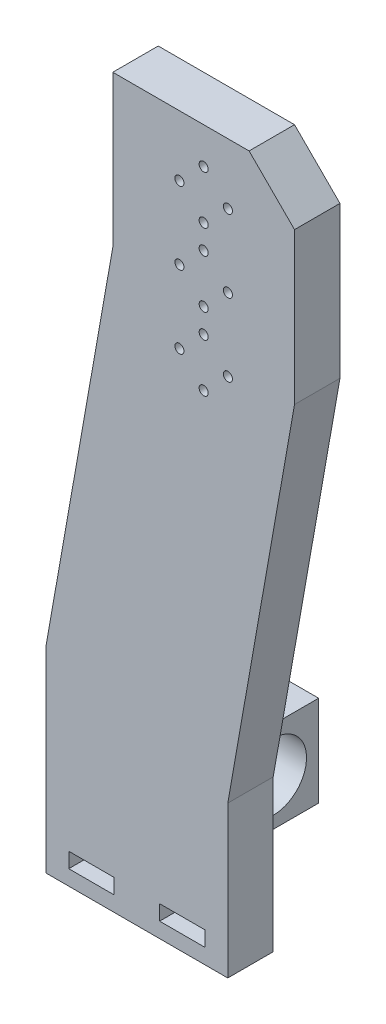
from build123d import *

# Parameters (mm, degrees)
CROQUIS1_R              = 1.5
CROQUIS1_W              = 15
CROQUIS1_H              = 5
SALIENTE_EXTRUIR1_DEPTH = 15
CROQUIS2_W              = 30
CROQUIS2_H              = 30
SALIENTE_EXTRUIR2_DEPTH = 30
CROQUIS3_R              = 11
CORTAR_EXTRUIR1_DEPTH   = 50


with BuildPart() as part:
    # Croquis1 → Saliente-Extruir1 (new body)
    with BuildSketch(Plane.XY):
        Polygon((0, 0), (60, 0), (60, 50), (82.040872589, 175), (82.040872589, 225), (67.040872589, 240), (22.040872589, 240), (22.040872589, 190), (0, 65), align=None)
        with Locations((44.040872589, 220)):
            Circle(CROQUIS1_R, mode=Mode.SUBTRACT)
        with Locations((52.040872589, 228)):
            Circle(CROQUIS1_R, mode=Mode.SUBTRACT)
        with Locations((60.040872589, 220)):
            Circle(CROQUIS1_R, mode=Mode.SUBTRACT)
        with Locations((52.040872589, 212)):
            Circle(CROQUIS1_R, mode=Mode.SUBTRACT)
        with Locations(Location((52.040872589, 204, 0), (0, 0, 180))):
            Circle(CROQUIS1_R, mode=Mode.SUBTRACT)
        with Locations(Location((60.040872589, 196, 0), (0, 0, 180))):
            Circle(CROQUIS1_R, mode=Mode.SUBTRACT)
        with Locations(Location((52.040872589, 188, 0), (0, 0, 180))):
            Circle(CROQUIS1_R, mode=Mode.SUBTRACT)
        with Locations(Location((44.040872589, 196, 0), (0, 0, 180))):
            Circle(CROQUIS1_R, mode=Mode.SUBTRACT)
        with Locations((44.040872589, 172)):
            Circle(CROQUIS1_R, mode=Mode.SUBTRACT)
        with Locations((52.040872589, 180)):
            Circle(CROQUIS1_R, mode=Mode.SUBTRACT)
        with Locations((60.040872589, 172)):
            Circle(CROQUIS1_R, mode=Mode.SUBTRACT)
        with Locations((52.040872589, 164)):
            Circle(CROQUIS1_R, mode=Mode.SUBTRACT)
        with Locations((15, 7.5)):
            Rectangle(CROQUIS1_W, CROQUIS1_H, mode=Mode.SUBTRACT)
        with Locations((45, 7.5)):
            Rectangle(CROQUIS1_W, CROQUIS1_H, mode=Mode.SUBTRACT)
    extrude(amount=SALIENTE_EXTRUIR1_DEPTH)

    # Croquis2 → Saliente-Extruir2 (add)
    with BuildSketch(Plane(origin=(0, 0, 0), x_dir=(-1, 0, 0), z_dir=(0, 0, -1))):
        with Locations((-30, 35)):
            Rectangle(CROQUIS2_W, CROQUIS2_H)
    extrude(amount=SALIENTE_EXTRUIR2_DEPTH)

    # Croquis3 → Cortar-Extruir1 (cut)
    with BuildSketch(Plane.ZY.offset(-15)):
        with Locations(Location((-15, 35, 0), (0, 0, 270))):
            Circle(CROQUIS3_R)
    extrude(amount=-CORTAR_EXTRUIR1_DEPTH, mode=Mode.SUBTRACT)


solid = part.part
